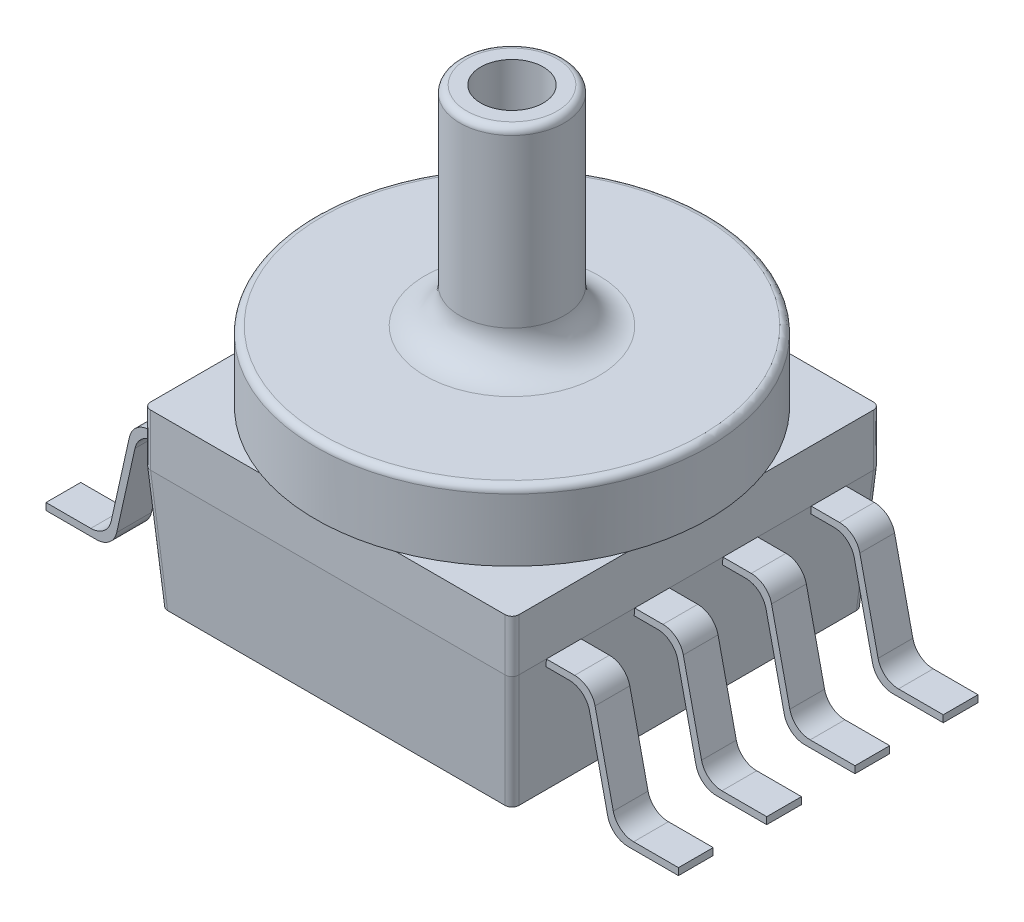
from build123d import *

# Parameters (mm, degrees)
ESBO_O1_W                          = 10.6
ESBO_O1_H                          = 10.6
RESSALTO_EXTRUS_O1_DEPTH           = 1.5
RESSALTO_EXTRUS_O1_OTHER_WAY_DEPTH = 3.5
RESSALTO_EXTRUS_O1_OTHER_WAY_TAPER = 4
FILETE1_R                          = 1
ESBO_O3_R                          = 0.9
CORTE_EXTRUS_O1_DEPTH              = 8
FILETE2_R                          = 0.2
RESSALTO_EXTRUS_O2_DEPTH           = 0.5
PADR_O_LINEAR1_COUNT               = 4
PADR_O_LINEAR1_PITCH               = 2.54


with BuildPart() as part:
    # Esbo_o1 → Ressalto-extrus_o1 (new body)
    with BuildSketch(Plane(origin=(0, 0, 0), x_dir=(1, 0, 0), z_dir=(0, 1, 0))):
        Rectangle(ESBO_O1_W, ESBO_O1_H)
    extrude(amount=RESSALTO_EXTRUS_O1_DEPTH)

    # Esbo_o1 → Ressalto-extrus_o1 other way (add)
    with BuildSketch(Plane(origin=(0, 0, 0), x_dir=(1, 0, 0), z_dir=(0, 1, 0))):
        Rectangle(ESBO_O1_W, ESBO_O1_H)
    extrude(amount=-RESSALTO_EXTRUS_O1_OTHER_WAY_DEPTH, taper=RESSALTO_EXTRUS_O1_OTHER_WAY_TAPER)

    # Esbo_o2 → Revolu_o1 (revolve)
    with BuildSketch(Plane.XY, mode=Mode.PRIVATE) as revolu_o1_sk:
        Polygon((0, 1.5), (-5.65, 1.5), (-5.65, 3.5), (-1.5, 3.5), (-1.5, 9.5), (0, 9.5), align=None)
    revolve(revolu_o1_sk.sketch.rotate(Axis((0, 0, 0), (0, 1, 0)), 270), axis=Axis((0, 0, 0), (0, 1, 0)))

    # Filete1
    filete1_edges = [part.edges().sort_by_distance(p)[0] for p in [
        (0, 3.5, 1.5),
    ]]
    fillet(filete1_edges, radius=FILETE1_R)

    # Esbo_o3 → Corte-extrus_o1 (cut)
    with BuildSketch(Plane(origin=(0, 9.5, 0), x_dir=(1, 0, 0), z_dir=(0, 1, 0))):
        with Locations(Location((0, 0, 0), (0, 0, 270))):
            Circle(ESBO_O3_R)
    extrude(amount=-CORTE_EXTRUS_O1_DEPTH, mode=Mode.SUBTRACT)

    # Filete2
    filete2_edges = [part.edges().sort_by_distance(p)[0] for p in [
        (5.3, 0.75, 5.3),
        (5.3, 0.75, -5.3),
        (-5.3, 0.75, -5.3),
        (-5.3, 0.75, 5.3),
        (0, 3.5, 5.65),
        (0, 9.5, 1.5),
        (5.177628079, -1.75, 5.177628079),
        (-5.177628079, -1.75, 5.177628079),
        (-5.177628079, -1.75, -5.177628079),
        (5.177628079, -1.75, -5.177628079),
    ]]
    fillet(filete2_edges, radius=FILETE2_R)

    # Esbo_o4 → Ressalto-extrus_o2 (add, symmetric)
    with BuildSketch(Plane.XY.offset(3.81)):
        with BuildLine():
            Line((-5.1, 0), (-6.114145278, 0))
            ThreePointArc((-6.114145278, 0), (-6.489532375, -0.131935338), (-6.69983006, -0.469718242))
            Line((-6.69983006, -0.469718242), (-7.224922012, -2.830281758))
            ThreePointArc((-7.224922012, -2.830281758), (-7.435219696, -3.168064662), (-7.810606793, -3.3))
            Line((-7.810606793, -3.3), (-9.1, -3.3))
            Line((-9.1, -3.3), (-9.1, -3.5))
            Line((-9.1, -3.5), (-7.650207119, -3.5))
            ThreePointArc((-7.650207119, -3.5), (-7.274820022, -3.368064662), (-7.064522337, -3.030281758))
            Line((-7.064522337, -3.030281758), (-6.539430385, -0.669718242))
            ThreePointArc((-6.539430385, -0.669718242), (-6.329132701, -0.331935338), (-5.953745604, -0.2))
            Line((-5.953745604, -0.2), (-5.086501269, -0.2))
            Line((-5.086501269, -0.2), (-5.1, 0))
        make_face()
        with BuildLine():
            Line((5.086501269, -0.2), (5.1, 0))
            Line((5.1, 0), (6.114145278, 0))
            ThreePointArc((6.114145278, 0), (6.489532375, -0.131935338), (6.69983006, -0.469718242))
            Line((6.69983006, -0.469718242), (7.224922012, -2.830281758))
            ThreePointArc((7.224922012, -2.830281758), (7.435219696, -3.168064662), (7.810606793, -3.3))
            Line((7.810606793, -3.3), (9.1, -3.3))
            Line((9.1, -3.3), (9.1, -3.5))
            Line((9.1, -3.5), (7.650207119, -3.5))
            ThreePointArc((7.650207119, -3.5), (7.274820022, -3.368064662), (7.064522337, -3.030281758))
            Line((7.064522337, -3.030281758), (6.539430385, -0.669718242))
            ThreePointArc((6.539430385, -0.669718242), (6.329132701, -0.331935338), (5.953745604, -0.2))
            Line((5.953745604, -0.2), (5.086501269, -0.2))
        make_face()
    ressalto_extrus_o2 = extrude(amount=RESSALTO_EXTRUS_O2_DEPTH, both=True)

    # Padr_o linear1: Ressalto-extrus_o2 ×4
    with Locations(*[(0, 0, -i * PADR_O_LINEAR1_PITCH) for i in range(1, PADR_O_LINEAR1_COUNT)]):
        add(ressalto_extrus_o2)


solid = part.part
